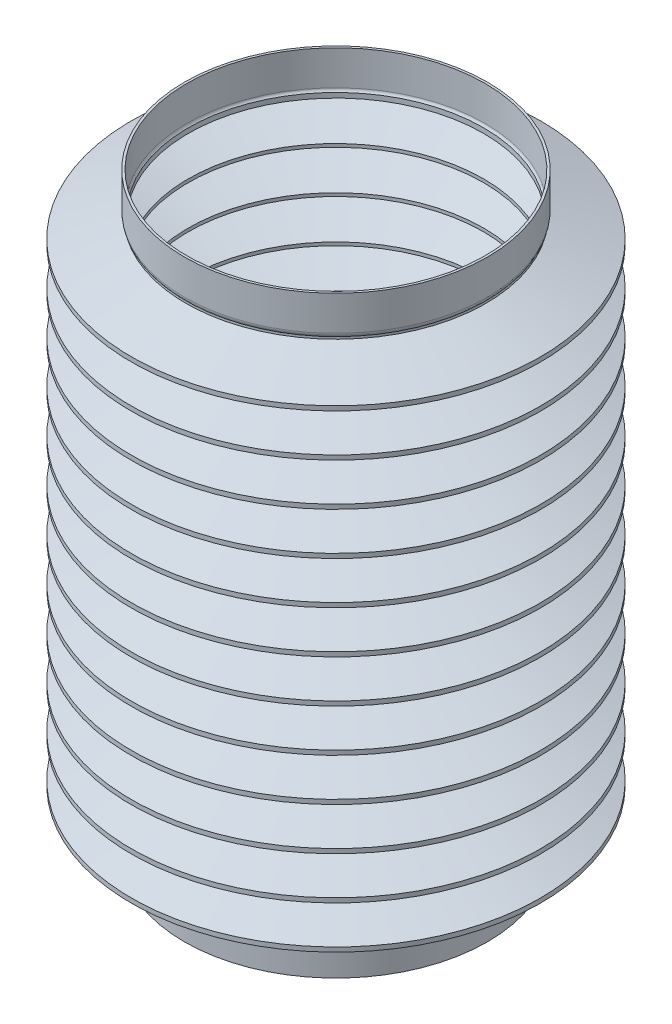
from build123d import *


with BuildPart() as part:
    # Sketch1 → Revolve1 (revolve)
    with BuildSketch(Plane.XY, mode=Mode.PRIVATE) as revolve1_sk:
        with BuildLine():
            Line((-66.016, 16.580993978), (-66.016, 18))
            Line((-66.016, 18), (-90, 26.384375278))
            Line((-90, 26.384375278), (-90, 28.365624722))
            Line((-90, 28.365624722), (-66.016, 36.75))
            Line((-66.016, 36.75), (-90, 45.134375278))
            Line((-90, 45.134375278), (-90, 47.115624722))
            Line((-90, 47.115624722), (-66.016, 55.5))
            Line((-66.016, 55.5), (-90, 63.884375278))
            Line((-90, 63.884375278), (-90, 65.865624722))
            Line((-90, 65.865624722), (-66.016, 74.25))
            Line((-66.016, 74.25), (-90, 82.634375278))
            Line((-90, 82.634375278), (-90, 84.615624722))
            Line((-90, 84.615624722), (-66.016, 93))
            Line((-66.016, 93), (-90, 101.384375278))
            Line((-90, 101.384375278), (-90, 103.365624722))
            Line((-90, 103.365624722), (-66.016, 111.75))
            Line((-66.016, 111.75), (-90, 120.134375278))
            Line((-90, 120.134375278), (-90, 122.115624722))
            Line((-90, 122.115624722), (-66.016, 130.5))
            Line((-66.016, 130.5), (-90, 138.884375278))
            Line((-90, 138.884375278), (-90, 140.865624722))
            Line((-90, 140.865624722), (-66.016, 149.25))
            Line((-66.016, 149.25), (-90, 157.634375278))
            Line((-90, 157.634375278), (-90, 159.615624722))
            Line((-90, 159.615624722), (-66.016, 168))
            Line((-66.016, 168), (-90, 176.384375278))
            Line((-90, 176.384375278), (-90, 178.365624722))
            Line((-90, 178.365624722), (-66.016, 186.75))
            Line((-66.016, 186.75), (-90, 195.134375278))
            Line((-90, 195.134375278), (-90, 197.115624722))
            Line((-90, 197.115624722), (-66.016, 205.5))
            Line((-66.016, 205.5), (-90, 213.884375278))
            Line((-90, 213.884375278), (-90, 215.865624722))
            Line((-90, 215.865624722), (-66.016, 224.25))
            Line((-66.016, 224.25), (-90, 232.634375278))
            Line((-90, 232.634375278), (-90, 234.615624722))
            Line((-90, 234.615624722), (-66.016, 243))
            Line((-66.016, 243), (-66.016, 243.995549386))
            ThreePointArc((-66.016, 243.995549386), (-66.504678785, 244.800568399), (-66.675, 245.726772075))
            Line((-66.675, 245.726772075), (-66.675, 261))
            Line((-66.675, 261), (-65.659, 261))
            Line((-65.659, 261), (-65.659, 245.726772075))
            ThreePointArc((-65.659, 245.726772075), (-65.48467904, 245.003528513), (-65, 244.439121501))
            Line((-65, 244.439121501), (-65, 242.278882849))
            Line((-65, 242.278882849), (-89.754942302, 233.625))
            Line((-89.754942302, 233.625), (-65, 224.971117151))
            Line((-65, 224.971117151), (-65, 223.528882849))
            Line((-65, 223.528882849), (-89.754942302, 214.875))
            Line((-89.754942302, 214.875), (-65, 206.221117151))
            Line((-65, 206.221117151), (-65, 204.778882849))
            Line((-65, 204.778882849), (-89.754942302, 196.125))
            Line((-89.754942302, 196.125), (-65, 187.471117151))
            Line((-65, 187.471117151), (-65, 186.028882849))
            Line((-65, 186.028882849), (-89.754942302, 177.375))
            Line((-89.754942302, 177.375), (-65, 168.721117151))
            Line((-65, 168.721117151), (-65, 167.278882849))
            Line((-65, 167.278882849), (-89.754942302, 158.625))
            Line((-89.754942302, 158.625), (-65, 149.971117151))
            Line((-65, 149.971117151), (-65, 148.528882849))
            Line((-65, 148.528882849), (-89.754942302, 139.875))
            Line((-89.754942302, 139.875), (-65, 131.221117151))
            Line((-65, 131.221117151), (-65, 129.778882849))
            Line((-65, 129.778882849), (-89.754942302, 121.125))
            Line((-89.754942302, 121.125), (-65, 112.471117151))
            Line((-65, 112.471117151), (-65, 111.028882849))
            Line((-65, 111.028882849), (-89.754942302, 102.375))
            Line((-89.754942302, 102.375), (-65, 93.721117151))
            Line((-65, 93.721117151), (-65, 92.278882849))
            Line((-65, 92.278882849), (-89.754942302, 83.625))
            Line((-89.754942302, 83.625), (-65, 74.971117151))
            Line((-65, 74.971117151), (-65, 73.528882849))
            Line((-65, 73.528882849), (-89.754942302, 64.875))
            Line((-89.754942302, 64.875), (-65, 56.221117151))
            Line((-65, 56.221117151), (-65, 54.778882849))
            Line((-65, 54.778882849), (-89.754942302, 46.125))
            Line((-89.754942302, 46.125), (-65, 37.471117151))
            Line((-65, 37.471117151), (-65, 36.028882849))
            Line((-65, 36.028882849), (-89.754942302, 27.375))
            Line((-89.754942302, 27.375), (-65, 18.721117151))
            Line((-65, 18.721117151), (-65, 16.137421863))
            ThreePointArc((-65, 16.137421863), (-65.48467904, 15.573014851), (-65.659, 14.849771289))
            Line((-65.659, 14.849771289), (-65.659, 0))
            Line((-65.659, 0), (-66.675, 0))
            Line((-66.675, 0), (-66.675, 14.849771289))
            ThreePointArc((-66.675, 14.849771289), (-66.504678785, 15.775974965), (-66.016, 16.580993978))
        make_face()
    revolve(revolve1_sk.sketch.rotate(Axis((0, 0, 0), (0, 1, 0)), 270), axis=Axis((0, 0, 0), (0, 1, 0)))


solid = part.part
